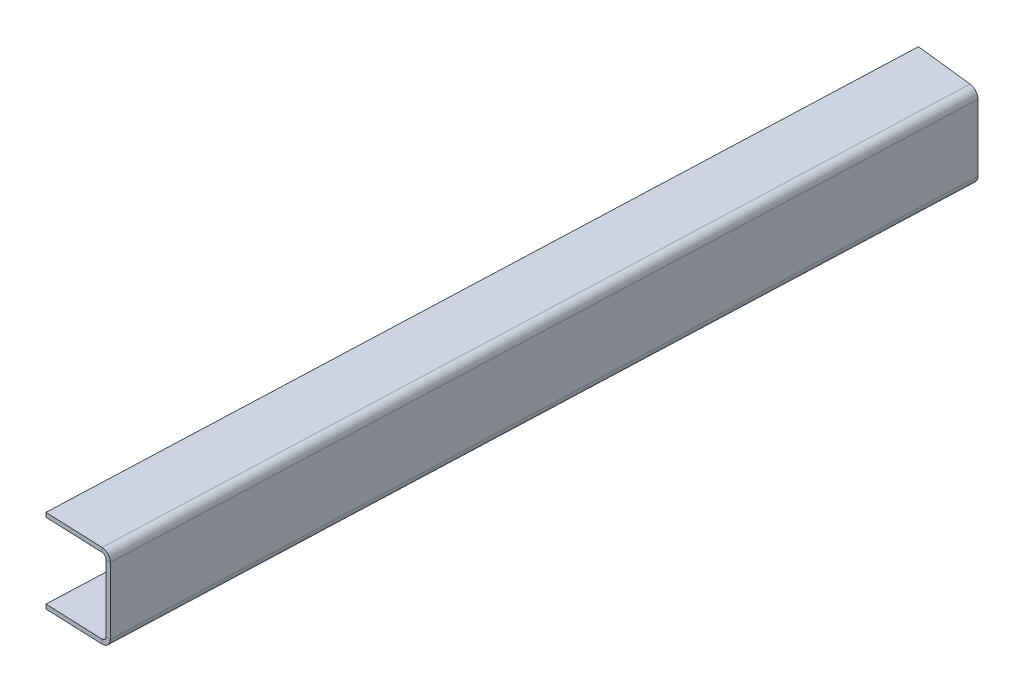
ISO-10303-21;
HEADER;
FILE_DESCRIPTION(('STEP AP214'),'2;1');
FILE_NAME('part.step','',(''),(''),'','','');
FILE_SCHEMA(('AUTOMOTIVE_DESIGN { 1 0 10303 214 1 1 1 1 }'));
ENDSEC;
DATA;
#1=APPLICATION_CONTEXT('core data for automotive mechanical design processes');
#2=APPLICATION_PROTOCOL_DEFINITION('international standard','automotive_design',2000,#1);
#3=PRODUCT_CONTEXT('',#1,'mechanical');
#4=PRODUCT('Part','Part','',(#3));
#5=PRODUCT_RELATED_PRODUCT_CATEGORY('part','',(#4));
#6=PRODUCT_DEFINITION_FORMATION('','',#4);
#7=PRODUCT_DEFINITION_CONTEXT('part definition',#1,'design');
#8=PRODUCT_DEFINITION('design','',#6,#7);
#9=PRODUCT_DEFINITION_SHAPE('','',#8);
#10=(LENGTH_UNIT() NAMED_UNIT(*) SI_UNIT(.MILLI.,.METRE.));
#11=(NAMED_UNIT(*) PLANE_ANGLE_UNIT() SI_UNIT($,.RADIAN.));
#12=(NAMED_UNIT(*) SI_UNIT($,.STERADIAN.) SOLID_ANGLE_UNIT());
#13=UNCERTAINTY_MEASURE_WITH_UNIT(LENGTH_MEASURE(1.E-05),#10,'distance_accuracy_value','');
#14=(GEOMETRIC_REPRESENTATION_CONTEXT(3) GLOBAL_UNCERTAINTY_ASSIGNED_CONTEXT((#13)) GLOBAL_UNIT_ASSIGNED_CONTEXT((#10,
#11,#12)) REPRESENTATION_CONTEXT('',''));
#15=CARTESIAN_POINT('',(0.,0.,0.));
#16=DIRECTION('',(0.,0.,1.));
#17=DIRECTION('',(1.,0.,0.));
#18=AXIS2_PLACEMENT_3D('',#15,#16,#17);
#19=CARTESIAN_POINT('',(2065.76313465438,-1.5585904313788E-13,-579.030473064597));
#20=DIRECTION('',(0.0392134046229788,0.,-0.999230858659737));
#21=DIRECTION('',(0.,1.,0.));
#22=AXIS2_PLACEMENT_3D('',#19,#20,#21);
#23=PLANE('',#22);
#24=DIRECTION('',(-0.999230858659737,0.,-0.0392134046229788));
#25=VECTOR('',#24,1.);
#26=CARTESIAN_POINT('',(2065.76313465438,-28.4987999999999,-579.030473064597));
#27=LINE('',#26,#25);
#28=CARTESIAN_POINT('',(2067.38748433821,-28.4987999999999,-578.966727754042));
#29=VERTEX_POINT('',#28);
#30=CARTESIAN_POINT('',(2065.76313465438,-28.4987999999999,-579.030473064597));
#31=VERTEX_POINT('',#30);
#32=EDGE_CURVE('E12',#29,#31,#27,.T.);
#33=ORIENTED_EDGE('',*,*,#32,.F.);
#34=DIRECTION('',(0.,1.,0.));
#35=VECTOR('',#34,1.);
#36=CARTESIAN_POINT('',(2067.38748433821,-1.5601120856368E-13,-578.966727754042));
#37=LINE('',#36,#35);
#38=CARTESIAN_POINT('',(2067.38748433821,-3.25120000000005,-578.966727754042));
#39=VERTEX_POINT('',#38);
#40=EDGE_CURVE('E134',#29,#39,#37,.T.);
#41=ORIENTED_EDGE('',*,*,#40,.T.);
#42=DIRECTION('',(-0.999230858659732,0.,-0.0392134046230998));
#43=VECTOR('',#42,1.);
#44=CARTESIAN_POINT('',(2065.76313465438,-3.25120000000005,-579.030473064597));
#45=LINE('',#44,#43);
#46=CARTESIAN_POINT('',(2065.76313465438,-3.25120000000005,-579.030473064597));
#47=VERTEX_POINT('',#46);
#48=EDGE_CURVE('E87',#39,#47,#45,.T.);
#49=ORIENTED_EDGE('',*,*,#48,.T.);
#50=DIRECTION('',(0.,1.,0.));
#51=VECTOR('',#50,1.);
#52=CARTESIAN_POINT('',(2065.76313465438,-1.5585904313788E-13,-579.030473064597));
#53=LINE('',#52,#51);
#54=EDGE_CURVE('E136',#31,#47,#53,.T.);
#55=ORIENTED_EDGE('',*,*,#54,.F.);
#56=EDGE_LOOP('',(#33,#41,#49,#55));
#57=FACE_BOUND('',#56,.T.);
#58=ADVANCED_FACE('F75',(#57),#23,.F.);
#59=CARTESIAN_POINT('',(2062.51450641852,-3.25120000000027,-579.159776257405));
#60=CARTESIAN_POINT('',(2061.97305652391,-3.25120000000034,-579.181024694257));
#61=CARTESIAN_POINT('',(2061.4316066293,-3.25120000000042,-579.202273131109));
#62=CARTESIAN_POINT('',(2060.89015673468,-3.25120000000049,-579.22352156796));
#63=CARTESIAN_POINT('',(2062.51450641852,-6.50240000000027,-579.159776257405));
#64=CARTESIAN_POINT('',(2061.97305652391,-7.58613333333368,-579.181024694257));
#65=CARTESIAN_POINT('',(2061.4316066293,-8.66986666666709,-579.202273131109));
#66=CARTESIAN_POINT('',(2060.89015673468,-9.75360000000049,-579.22352156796));
#67=CARTESIAN_POINT('',(2065.76313465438,-6.50239999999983,-579.030473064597));
#68=CARTESIAN_POINT('',(2066.30458454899,-7.58613333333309,-579.009224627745));
#69=CARTESIAN_POINT('',(2066.8460344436,-8.66986666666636,-578.987976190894));
#70=CARTESIAN_POINT('',(2067.38748433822,-9.75359999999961,-578.966727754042));
#71=CARTESIAN_POINT('',(2065.76313465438,-3.25119999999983,-579.030473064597));
#72=CARTESIAN_POINT('',(2066.30458454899,-3.25119999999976,-579.009224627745));
#73=CARTESIAN_POINT('',(2066.8460344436,-3.25119999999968,-578.987976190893));
#74=CARTESIAN_POINT('',(2067.38748433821,-3.25119999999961,-578.966727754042));
#75=CARTESIAN_POINT('',(2065.76313465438,1.69135538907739E-13,-579.030473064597));
#76=CARTESIAN_POINT('',(2066.30458454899,1.08373333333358,-579.009224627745));
#77=CARTESIAN_POINT('',(2066.8460344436,2.16746666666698,-578.987976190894));
#78=CARTESIAN_POINT('',(2067.38748433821,3.25120000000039,-578.966727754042));
#79=CARTESIAN_POINT('',(2062.51450641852,-2.70616862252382E-13,-579.159776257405));
#80=CARTESIAN_POINT('',(2061.97305652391,1.08373333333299,-579.181024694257));
#81=CARTESIAN_POINT('',(2061.43160662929,2.16746666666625,-579.202273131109));
#82=CARTESIAN_POINT('',(2060.89015673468,3.25119999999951,-579.22352156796));
#83=CARTESIAN_POINT('',(2062.51450641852,-3.25120000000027,-579.159776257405));
#84=CARTESIAN_POINT('',(2061.97305652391,-3.25120000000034,-579.181024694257));
#85=CARTESIAN_POINT('',(2061.4316066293,-3.25120000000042,-579.202273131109));
#86=CARTESIAN_POINT('',(2060.89015673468,-3.25120000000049,-579.22352156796));
#87=(BOUNDED_SURFACE() B_SPLINE_SURFACE(3,3,((#59,#60,#61,#62),(#63,#64,#65,#66),(#67,#68,#69,
#70),(#71,#72,#73,#74),(#75,#76,#77,#78),(#79,#80,#81,#82),(#83,#84,#85,#86)),.UNSPECIFIED.,.T.,
.F.,.F.) B_SPLINE_SURFACE_WITH_KNOTS((4,3,4),(4,4),(0.,0.5,1.),(0.,1.),
.UNSPECIFIED.) GEOMETRIC_REPRESENTATION_ITEM() RATIONAL_B_SPLINE_SURFACE(((1.,1.,1.,1.),
(0.333333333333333,0.333333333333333,0.333333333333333,0.333333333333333),(0.333333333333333,
0.333333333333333,0.333333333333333,0.333333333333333),(1.,1.,1.,1.),(0.333333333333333,
0.333333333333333,0.333333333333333,0.333333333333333),(0.333333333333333,0.333333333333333,
0.333333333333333,0.333333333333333),(1.,1.,1.,1.))) REPRESENTATION_ITEM('') SURFACE());
#88=CARTESIAN_POINT('',(2064.13882053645,-3.25120000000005,-579.095124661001));
#89=DIRECTION('',(-0.0394921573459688,0.,0.999219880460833));
#90=DIRECTION('',(-0.999219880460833,-1.35258484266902E-13,-0.0394921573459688));
#91=AXIS2_PLACEMENT_3D('',#88,#89,#90);
#92=ELLIPSE('',#91,3.25120012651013,3.2512);
#93=CARTESIAN_POINT('',(2064.13882053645,0.,-579.095124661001));
#94=VERTEX_POINT('',#93);
#95=EDGE_CURVE('E212',#39,#94,#92,.T.);
#96=DIRECTION('',(0.,-1.,0.));
#97=VECTOR('',#96,1.);
#98=CARTESIAN_POINT('',(2064.13882053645,-1.62560000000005,-579.095124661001));
#99=LINE('',#98,#97);
#100=CARTESIAN_POINT('',(2064.13882053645,-1.62560000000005,-579.095124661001));
#101=VERTEX_POINT('',#100);
#102=EDGE_CURVE('E202',#94,#101,#99,.T.);
#103=CARTESIAN_POINT('',(2064.13882053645,-3.25120000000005,-579.095124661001));
#104=DIRECTION('',(-0.0397709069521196,0.,0.999208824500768));
#105=DIRECTION('',(-0.999208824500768,-1.35321803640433E-13,-0.0397709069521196));
#106=AXIS2_PLACEMENT_3D('',#103,#104,#105);
#107=ELLIPSE('',#106,1.62560025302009,1.6256);
#108=EDGE_CURVE('E210',#47,#101,#107,.T.);
#109=ORIENTED_EDGE('',*,*,#48,.F.);
#110=ORIENTED_EDGE('',*,*,#95,.T.);
#111=ORIENTED_EDGE('',*,*,#102,.T.);
#112=ORIENTED_EDGE('',*,*,#108,.F.);
#113=EDGE_LOOP('',(#109,#110,#111,#112));
#114=FACE_BOUND('',#113,.T.);
#115=ADVANCED_FACE('F209',(#114),#87,.F.);
#116=CARTESIAN_POINT('',(2042.00315002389,-1.62560000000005,-579.976177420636));
#117=DIRECTION('',(-0.0397709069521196,0.,0.999208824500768));
#118=DIRECTION('',(0.999208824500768,0.,0.0397709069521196));
#119=AXIS2_PLACEMENT_3D('',#116,#117,#118);
#120=PLANE('',#119);
#121=ORIENTED_EDGE('',*,*,#102,.F.);
#122=DIRECTION('',(0.999208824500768,0.,0.0397709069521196));
#123=VECTOR('',#122,1.);
#124=CARTESIAN_POINT('',(2042.00315002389,0.,-579.976177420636));
#125=LINE('',#124,#123);
#126=CARTESIAN_POINT('',(2042.00315002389,0.,-579.976177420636));
#127=VERTEX_POINT('',#126);
#128=EDGE_CURVE('E173',#127,#94,#125,.T.);
#129=ORIENTED_EDGE('',*,*,#128,.F.);
#130=DIRECTION('',(0.,-1.,0.));
#131=VECTOR('',#130,1.);
#132=CARTESIAN_POINT('',(2042.00315002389,-1.62560000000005,-579.976177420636));
#133=LINE('',#132,#131);
#134=CARTESIAN_POINT('',(2042.00315002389,-1.62560000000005,-579.976177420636));
#135=VERTEX_POINT('',#134);
#136=EDGE_CURVE('E199',#127,#135,#133,.T.);
#137=ORIENTED_EDGE('',*,*,#136,.T.);
#138=DIRECTION('',(0.999208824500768,0.,0.0397709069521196));
#139=VECTOR('',#138,1.);
#140=CARTESIAN_POINT('',(2042.00315002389,-1.62560000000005,-579.976177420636));
#141=LINE('',#140,#139);
#142=EDGE_CURVE('E229',#135,#101,#141,.T.);
#143=ORIENTED_EDGE('',*,*,#142,.T.);
#144=EDGE_LOOP('',(#121,#129,#137,#143));
#145=FACE_BOUND('',#144,.T.);
#146=ADVANCED_FACE('F230',(#145),#120,.T.);
#147=CARTESIAN_POINT('',(2054.49718988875,-1.62560000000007,-898.34767059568));
#148=DIRECTION('',(-0.999230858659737,0.,-0.0392134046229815));
#149=DIRECTION('',(-0.0392134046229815,0.,0.999230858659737));
#150=AXIS2_PLACEMENT_3D('',#147,#148,#149);
#151=PLANE('',#150);
#152=ORIENTED_EDGE('',*,*,#136,.F.);
#153=DIRECTION('',(-0.0392134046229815,0.,0.999230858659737));
#154=VECTOR('',#153,1.);
#155=CARTESIAN_POINT('',(2054.49718988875,0.,-898.34767059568));
#156=LINE('',#155,#154);
#157=CARTESIAN_POINT('',(2054.49718988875,0.,-898.34767059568));
#158=VERTEX_POINT('',#157);
#159=EDGE_CURVE('E165',#158,#127,#156,.T.);
#160=ORIENTED_EDGE('',*,*,#159,.F.);
#161=DIRECTION('',(0.,-1.,0.));
#162=VECTOR('',#161,1.);
#163=CARTESIAN_POINT('',(2054.49718988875,-1.62560000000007,-898.34767059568));
#164=LINE('',#163,#162);
#165=CARTESIAN_POINT('',(2054.49718988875,-1.62560000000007,-898.34767059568));
#166=VERTEX_POINT('',#165);
#167=EDGE_CURVE('E196',#158,#166,#164,.T.);
#168=ORIENTED_EDGE('',*,*,#167,.T.);
#169=DIRECTION('',(-0.0392134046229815,0.,0.999230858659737));
#170=VECTOR('',#169,1.);
#171=CARTESIAN_POINT('',(2054.49718988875,-1.62560000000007,-898.34767059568));
#172=LINE('',#171,#170);
#173=EDGE_CURVE('E234',#166,#135,#172,.T.);
#174=ORIENTED_EDGE('',*,*,#173,.T.);
#175=EDGE_LOOP('',(#152,#160,#168,#174));
#176=FACE_BOUND('',#175,.T.);
#177=ADVANCED_FACE('F277',(#176),#151,.T.);
#178=CARTESIAN_POINT('',(2079.80427081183,-1.62560000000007,-895.481716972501));
#179=DIRECTION('',(0.112527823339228,0.,-0.993648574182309));
#180=DIRECTION('',(-0.993648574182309,0.,-0.112527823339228));
#181=AXIS2_PLACEMENT_3D('',#178,#179,#180);
#182=PLANE('',#181);
#183=ORIENTED_EDGE('',*,*,#167,.F.);
#184=DIRECTION('',(-0.993648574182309,0.,-0.112527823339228));
#185=VECTOR('',#184,1.);
#186=CARTESIAN_POINT('',(2079.80427081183,0.,-895.481716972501));
#187=LINE('',#186,#185);
#188=CARTESIAN_POINT('',(2076.56934251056,0.,-895.848063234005));
#189=VERTEX_POINT('',#188);
#190=EDGE_CURVE('E170',#189,#158,#187,.T.);
#191=ORIENTED_EDGE('',*,*,#190,.F.);
#192=DIRECTION('',(0.,-1.,-1.36592399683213E-13));
#193=VECTOR('',#192,1.);
#194=CARTESIAN_POINT('',(2076.56934251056,-1.62560000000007,-895.848063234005));
#195=LINE('',#194,#193);
#196=CARTESIAN_POINT('',(2076.56934251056,-1.62560000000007,-895.848063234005));
#197=VERTEX_POINT('',#196);
#198=EDGE_CURVE('E193',#189,#197,#195,.T.);
#199=ORIENTED_EDGE('',*,*,#198,.T.);
#200=DIRECTION('',(-0.993648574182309,0.,-0.112527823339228));
#201=VECTOR('',#200,1.);
#202=CARTESIAN_POINT('',(2079.80427081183,-1.62560000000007,-895.481716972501));
#203=LINE('',#202,#201);
#204=EDGE_CURVE('E235',#197,#166,#203,.T.);
#205=ORIENTED_EDGE('',*,*,#204,.T.);
#206=EDGE_LOOP('',(#183,#191,#199,#205));
#207=FACE_BOUND('',#206,.T.);
#208=ADVANCED_FACE('F304',(#207),#182,.T.);
#209=CARTESIAN_POINT('',(2074.94968933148,-3.25120000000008,-896.031484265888));
#210=CARTESIAN_POINT('',(2074.40823943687,-3.25120000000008,-896.05273270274));
#211=CARTESIAN_POINT('',(2073.86678954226,-3.25120000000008,-896.073981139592));
#212=CARTESIAN_POINT('',(2073.32533964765,-3.25120000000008,-896.095229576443));
#213=CARTESIAN_POINT('',(2074.94968933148,0.,-896.031484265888));
#214=CARTESIAN_POINT('',(2074.40823943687,1.08373333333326,-896.05273270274));
#215=CARTESIAN_POINT('',(2073.86678954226,2.16746666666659,-896.073981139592));
#216=CARTESIAN_POINT('',(2073.32533964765,3.25119999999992,-896.095229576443));
#217=CARTESIAN_POINT('',(2078.18899568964,0.,-895.664642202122));
#218=CARTESIAN_POINT('',(2078.73044558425,1.08373333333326,-895.64339376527));
#219=CARTESIAN_POINT('',(2079.27189547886,2.16746666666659,-895.622145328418));
#220=CARTESIAN_POINT('',(2079.81334537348,3.25119999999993,-895.600896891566));
#221=CARTESIAN_POINT('',(2078.18899568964,-3.25120000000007,-895.664642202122));
#222=CARTESIAN_POINT('',(2078.73044558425,-3.25120000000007,-895.64339376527));
#223=CARTESIAN_POINT('',(2079.27189547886,-3.25120000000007,-895.622145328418));
#224=CARTESIAN_POINT('',(2079.81334537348,-3.25120000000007,-895.600896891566));
#225=CARTESIAN_POINT('',(2078.18899568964,-6.50240000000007,-895.664642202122));
#226=CARTESIAN_POINT('',(2078.73044558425,-7.58613333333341,-895.64339376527));
#227=CARTESIAN_POINT('',(2079.27189547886,-8.66986666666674,-895.622145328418));
#228=CARTESIAN_POINT('',(2079.81334537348,-9.75360000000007,-895.600896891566));
#229=CARTESIAN_POINT('',(2074.94968933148,-6.50240000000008,-896.031484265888));
#230=CARTESIAN_POINT('',(2074.40823943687,-7.58613333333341,-896.05273270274));
#231=CARTESIAN_POINT('',(2073.86678954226,-8.66986666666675,-896.073981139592));
#232=CARTESIAN_POINT('',(2073.32533964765,-9.75360000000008,-896.095229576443));
#233=CARTESIAN_POINT('',(2074.94968933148,-3.25120000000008,-896.031484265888));
#234=CARTESIAN_POINT('',(2074.40823943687,-3.25120000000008,-896.05273270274));
#235=CARTESIAN_POINT('',(2073.86678954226,-3.25120000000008,-896.073981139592));
#236=CARTESIAN_POINT('',(2073.32533964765,-3.25120000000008,-896.095229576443));
#237=(BOUNDED_SURFACE() B_SPLINE_SURFACE(3,3,((#209,#210,#211,#212),(#213,#214,#215,#216),(#217,
#218,#219,#220),(#221,#222,#223,#224),(#225,#226,#227,#228),(#229,#230,#231,#232),(#233,#234,
#235,#236)),.UNSPECIFIED.,.T.,.F.,.F.) B_SPLINE_SURFACE_WITH_KNOTS((4,3,4),(4,4),(0.,0.5,1.),
(0.,1.),.UNSPECIFIED.) GEOMETRIC_REPRESENTATION_ITEM() RATIONAL_B_SPLINE_SURFACE(((1.,1.,1.,1.),
(0.333333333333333,0.333333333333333,0.333333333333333,0.333333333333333),(0.333333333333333,
0.333333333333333,0.333333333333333,0.333333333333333),(1.,1.,1.,1.),(0.333333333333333,
0.333333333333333,0.333333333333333,0.333333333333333),(0.333333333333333,0.333333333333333,
0.333333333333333,0.333333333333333),(1.,1.,1.,1.))) REPRESENTATION_ITEM('') SURFACE());
#238=CARTESIAN_POINT('',(2076.56934251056,-3.25120000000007,-895.848063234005));
#239=DIRECTION('',(0.0759715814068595,0.,-0.997109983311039));
#240=DIRECTION('',(-0.997109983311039,0.,-0.0759715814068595));
#241=AXIS2_PLACEMENT_3D('',#238,#239,#240);
#242=ELLIPSE('',#241,3.25340525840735,3.2512);
#243=CARTESIAN_POINT('',(2079.81334537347,-3.25120000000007,-895.600896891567));
#244=VERTEX_POINT('',#243);
#245=EDGE_CURVE('E175',#189,#244,#242,.T.);
#246=DIRECTION('',(-0.999230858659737,0.,-0.0392134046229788));
#247=VECTOR('',#246,1.);
#248=CARTESIAN_POINT('',(2078.18899568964,-3.25120000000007,-895.664642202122));
#249=LINE('',#248,#247);
#250=CARTESIAN_POINT('',(2078.18899568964,-3.25120000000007,-895.664642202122));
#251=VERTEX_POINT('',#250);
#252=EDGE_CURVE('E191',#244,#251,#249,.T.);
#253=CARTESIAN_POINT('',(2076.56934251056,-3.25120000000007,-895.848063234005));
#254=DIRECTION('',(0.112527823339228,0.,-0.993648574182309));
#255=DIRECTION('',(-0.993648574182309,0.,-0.112527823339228));
#256=AXIS2_PLACEMENT_3D('',#253,#254,#255);
#257=ELLIPSE('',#256,1.63000604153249,1.6256);
#258=EDGE_CURVE('E226',#197,#251,#257,.T.);
#259=ORIENTED_EDGE('',*,*,#198,.F.);
#260=ORIENTED_EDGE('',*,*,#245,.T.);
#261=ORIENTED_EDGE('',*,*,#252,.T.);
#262=ORIENTED_EDGE('',*,*,#258,.F.);
#263=EDGE_LOOP('',(#259,#260,#261,#262));
#264=FACE_BOUND('',#263,.T.);
#265=ADVANCED_FACE('F354',(#264),#237,.F.);
#266=CARTESIAN_POINT('',(2078.18899568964,-1.49842588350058E-13,-895.664642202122));
#267=DIRECTION('',(-0.0392134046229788,0.,0.999230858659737));
#268=DIRECTION('',(0.,-1.,0.));
#269=AXIS2_PLACEMENT_3D('',#266,#267,#268);
#270=PLANE('',#269);
#271=ORIENTED_EDGE('',*,*,#252,.F.);
#272=DIRECTION('',(0.,1.,0.));
#273=VECTOR('',#272,1.);
#274=CARTESIAN_POINT('',(2079.81334537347,-1.5601120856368E-13,-895.600896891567));
#275=LINE('',#274,#273);
#276=CARTESIAN_POINT('',(2079.81334537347,-28.4988,-895.600896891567));
#277=VERTEX_POINT('',#276);
#278=EDGE_CURVE('E164',#244,#277,#275,.F.);
#279=ORIENTED_EDGE('',*,*,#278,.T.);
#280=DIRECTION('',(-0.999230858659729,0.,-0.0392134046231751));
#281=VECTOR('',#280,1.);
#282=CARTESIAN_POINT('',(2078.18899568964,-28.4988,-895.664642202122));
#283=LINE('',#282,#281);
#284=CARTESIAN_POINT('',(2078.18899568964,-28.4988,-895.664642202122));
#285=VERTEX_POINT('',#284);
#286=EDGE_CURVE('E188',#277,#285,#283,.T.);
#287=ORIENTED_EDGE('',*,*,#286,.T.);
#288=DIRECTION('',(0.,-1.,0.));
#289=VECTOR('',#288,1.);
#290=CARTESIAN_POINT('',(2078.18899568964,-1.49842588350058E-13,-895.664642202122));
#291=LINE('',#290,#289);
#292=EDGE_CURVE('E281',#251,#285,#291,.T.);
#293=ORIENTED_EDGE('',*,*,#292,.F.);
#294=EDGE_LOOP('',(#271,#279,#287,#293));
#295=FACE_BOUND('',#294,.T.);
#296=ADVANCED_FACE('F319',(#295),#270,.F.);
#297=CARTESIAN_POINT('',(2078.18899568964,-28.4988,-895.664642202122));
#298=CARTESIAN_POINT('',(2078.73044558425,-28.4988,-895.64339376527));
#299=CARTESIAN_POINT('',(2079.27189547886,-28.4988,-895.622145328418));
#300=CARTESIAN_POINT('',(2079.81334537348,-28.4988,-895.600896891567));
#301=CARTESIAN_POINT('',(2078.18899568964,-31.75,-895.664642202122));
#302=CARTESIAN_POINT('',(2078.73044558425,-32.8337333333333,-895.64339376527));
#303=CARTESIAN_POINT('',(2079.27189547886,-33.9174666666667,-895.622145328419));
#304=CARTESIAN_POINT('',(2079.81334537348,-35.0012,-895.600896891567));
#305=CARTESIAN_POINT('',(2074.94968933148,-31.75,-896.031484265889));
#306=CARTESIAN_POINT('',(2074.40823943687,-32.8337333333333,-896.052732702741));
#307=CARTESIAN_POINT('',(2073.86678954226,-33.9174666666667,-896.073981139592));
#308=CARTESIAN_POINT('',(2073.32533964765,-35.0012,-896.095229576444));
#309=CARTESIAN_POINT('',(2074.94968933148,-28.4988,-896.031484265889));
#310=CARTESIAN_POINT('',(2074.40823943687,-28.4988,-896.052732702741));
#311=CARTESIAN_POINT('',(2073.86678954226,-28.4988,-896.073981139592));
#312=CARTESIAN_POINT('',(2073.32533964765,-28.4988,-896.095229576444));
#313=CARTESIAN_POINT('',(2074.94968933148,-25.2476,-896.031484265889));
#314=CARTESIAN_POINT('',(2074.40823943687,-24.1638666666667,-896.052732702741));
#315=CARTESIAN_POINT('',(2073.86678954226,-23.0801333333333,-896.073981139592));
#316=CARTESIAN_POINT('',(2073.32533964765,-21.9964,-896.095229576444));
#317=CARTESIAN_POINT('',(2078.18899568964,-25.2476,-895.664642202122));
#318=CARTESIAN_POINT('',(2078.73044558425,-24.1638666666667,-895.64339376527));
#319=CARTESIAN_POINT('',(2079.27189547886,-23.0801333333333,-895.622145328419));
#320=CARTESIAN_POINT('',(2079.81334537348,-21.9964,-895.600896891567));
#321=CARTESIAN_POINT('',(2078.18899568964,-28.4988,-895.664642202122));
#322=CARTESIAN_POINT('',(2078.73044558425,-28.4988,-895.64339376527));
#323=CARTESIAN_POINT('',(2079.27189547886,-28.4988,-895.622145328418));
#324=CARTESIAN_POINT('',(2079.81334537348,-28.4988,-895.600896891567));
#325=(BOUNDED_SURFACE() B_SPLINE_SURFACE(3,3,((#297,#298,#299,#300),(#301,#302,#303,#304),(#305,
#306,#307,#308),(#309,#310,#311,#312),(#313,#314,#315,#316),(#317,#318,#319,#320),(#321,#322,
#323,#324)),.UNSPECIFIED.,.T.,.F.,.F.) B_SPLINE_SURFACE_WITH_KNOTS((4,3,4),(4,4),(0.,0.5,1.),
(0.,1.),.UNSPECIFIED.) GEOMETRIC_REPRESENTATION_ITEM() RATIONAL_B_SPLINE_SURFACE(((1.,1.,1.,1.),
(0.333333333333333,0.333333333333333,0.333333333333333,0.333333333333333),(0.333333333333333,
0.333333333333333,0.333333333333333,0.333333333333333),(1.,1.,1.,1.),(0.333333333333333,
0.333333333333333,0.333333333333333,0.333333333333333),(0.333333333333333,0.333333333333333,
0.333333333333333,0.333333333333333),(1.,1.,1.,1.))) REPRESENTATION_ITEM('') SURFACE());
#326=CARTESIAN_POINT('',(2076.56934251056,-28.4988,-895.848063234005));
#327=DIRECTION('',(0.0759715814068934,0.,-0.997109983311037));
#328=DIRECTION('',(0.997109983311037,0.,0.0759715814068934));
#329=AXIS2_PLACEMENT_3D('',#326,#327,#328);
#330=ELLIPSE('',#329,3.25340525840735,3.2512);
#331=CARTESIAN_POINT('',(2076.56934251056,-31.75,-895.848063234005));
#332=VERTEX_POINT('',#331);
#333=EDGE_CURVE('E152',#277,#332,#330,.T.);
#334=DIRECTION('',(0.,1.,0.));
#335=VECTOR('',#334,1.);
#336=CARTESIAN_POINT('',(2076.56934251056,-30.1244,-895.848063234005));
#337=LINE('',#336,#335);
#338=CARTESIAN_POINT('',(2076.56934251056,-30.1244,-895.848063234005));
#339=VERTEX_POINT('',#338);
#340=EDGE_CURVE('E185',#332,#339,#337,.T.);
#341=CARTESIAN_POINT('',(2076.56934251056,-28.4988,-895.848063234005));
#342=DIRECTION('',(0.112527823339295,0.,-0.993648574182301));
#343=DIRECTION('',(0.993648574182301,0.,0.112527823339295));
#344=AXIS2_PLACEMENT_3D('',#341,#342,#343);
#345=ELLIPSE('',#344,1.6300060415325,1.6256);
#346=EDGE_CURVE('E251',#285,#339,#345,.T.);
#347=ORIENTED_EDGE('',*,*,#286,.F.);
#348=ORIENTED_EDGE('',*,*,#333,.T.);
#349=ORIENTED_EDGE('',*,*,#340,.T.);
#350=ORIENTED_EDGE('',*,*,#346,.F.);
#351=EDGE_LOOP('',(#347,#348,#349,#350));
#352=FACE_BOUND('',#351,.T.);
#353=ADVANCED_FACE('F323',(#352),#325,.F.);
#354=CARTESIAN_POINT('',(2054.49718988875,-30.1244,-898.347670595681));
#355=DIRECTION('',(0.112527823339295,0.,-0.993648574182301));
#356=DIRECTION('',(0.993648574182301,0.,0.112527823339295));
#357=AXIS2_PLACEMENT_3D('',#354,#355,#356);
#358=PLANE('',#357);
#359=ORIENTED_EDGE('',*,*,#340,.F.);
#360=DIRECTION('',(0.993648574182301,0.,0.112527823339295));
#361=VECTOR('',#360,1.);
#362=CARTESIAN_POINT('',(2054.49718988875,-31.75,-898.347670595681));
#363=LINE('',#362,#361);
#364=CARTESIAN_POINT('',(2054.49718988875,-31.75,-898.347670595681));
#365=VERTEX_POINT('',#364);
#366=EDGE_CURVE('E259',#365,#332,#363,.T.);
#367=ORIENTED_EDGE('',*,*,#366,.F.);
#368=DIRECTION('',(0.,1.,0.));
#369=VECTOR('',#368,1.);
#370=CARTESIAN_POINT('',(2054.49718988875,-30.1244,-898.347670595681));
#371=LINE('',#370,#369);
#372=CARTESIAN_POINT('',(2054.49718988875,-30.1244,-898.347670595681));
#373=VERTEX_POINT('',#372);
#374=EDGE_CURVE('E182',#365,#373,#371,.T.);
#375=ORIENTED_EDGE('',*,*,#374,.T.);
#376=DIRECTION('',(0.993648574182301,0.,0.112527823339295));
#377=VECTOR('',#376,1.);
#378=CARTESIAN_POINT('',(2054.49718988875,-30.1244,-898.347670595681));
#379=LINE('',#378,#377);
#380=EDGE_CURVE('E290',#373,#339,#379,.T.);
#381=ORIENTED_EDGE('',*,*,#380,.T.);
#382=EDGE_LOOP('',(#359,#367,#375,#381));
#383=FACE_BOUND('',#382,.T.);
#384=ADVANCED_FACE('F371',(#383),#358,.T.);
#385=CARTESIAN_POINT('',(2042.00315002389,-30.1243999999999,-579.976177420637));
#386=DIRECTION('',(-0.999230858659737,0.,-0.0392134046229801));
#387=DIRECTION('',(0.0392134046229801,0.,-0.999230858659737));
#388=AXIS2_PLACEMENT_3D('',#385,#386,#387);
#389=PLANE('',#388);
#390=ORIENTED_EDGE('',*,*,#374,.F.);
#391=DIRECTION('',(0.0392134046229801,0.,-0.999230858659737));
#392=VECTOR('',#391,1.);
#393=CARTESIAN_POINT('',(2042.00315002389,-31.7499999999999,-579.976177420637));
#394=LINE('',#393,#392);
#395=CARTESIAN_POINT('',(2042.00315002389,-31.7499999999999,-579.976177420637));
#396=VERTEX_POINT('',#395);
#397=EDGE_CURVE('E252',#396,#365,#394,.T.);
#398=ORIENTED_EDGE('',*,*,#397,.F.);
#399=DIRECTION('',(0.,1.,0.));
#400=VECTOR('',#399,1.);
#401=CARTESIAN_POINT('',(2042.00315002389,-30.1243999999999,-579.976177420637));
#402=LINE('',#401,#400);
#403=CARTESIAN_POINT('',(2042.00315002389,-30.1243999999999,-579.976177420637));
#404=VERTEX_POINT('',#403);
#405=EDGE_CURVE('E179',#396,#404,#402,.T.);
#406=ORIENTED_EDGE('',*,*,#405,.T.);
#407=DIRECTION('',(0.0392134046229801,0.,-0.999230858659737));
#408=VECTOR('',#407,1.);
#409=CARTESIAN_POINT('',(2042.00315002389,-30.1243999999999,-579.976177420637));
#410=LINE('',#409,#408);
#411=EDGE_CURVE('E293',#404,#373,#410,.T.);
#412=ORIENTED_EDGE('',*,*,#411,.T.);
#413=EDGE_LOOP('',(#390,#398,#406,#412));
#414=FACE_BOUND('',#413,.T.);
#415=ADVANCED_FACE('F379',(#414),#389,.T.);
#416=CARTESIAN_POINT('',(2067.38305811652,-30.1243999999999,-578.96599622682));
#417=DIRECTION('',(-0.0397709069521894,0.,0.999208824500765));
#418=DIRECTION('',(-0.999208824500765,0.,-0.0397709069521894));
#419=AXIS2_PLACEMENT_3D('',#416,#417,#418);
#420=PLANE('',#419);
#421=ORIENTED_EDGE('',*,*,#405,.F.);
#422=DIRECTION('',(-0.999208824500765,0.,-0.0397709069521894));
#423=VECTOR('',#422,1.);
#424=CARTESIAN_POINT('',(2067.38305811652,-31.7499999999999,-578.96599622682));
#425=LINE('',#424,#423);
#426=CARTESIAN_POINT('',(2064.13882053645,-31.7499999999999,-579.095124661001));
#427=VERTEX_POINT('',#426);
#428=EDGE_CURVE('E256',#427,#396,#425,.T.);
#429=ORIENTED_EDGE('',*,*,#428,.F.);
#430=DIRECTION('',(2.30499674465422E-13,1.,0.));
#431=VECTOR('',#430,1.);
#432=CARTESIAN_POINT('',(2064.13882053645,-30.1243999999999,-579.095124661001));
#433=LINE('',#432,#431);
#434=CARTESIAN_POINT('',(2064.13882053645,-30.1243999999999,-579.095124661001));
#435=VERTEX_POINT('',#434);
#436=EDGE_CURVE('E81',#427,#435,#433,.T.);
#437=ORIENTED_EDGE('',*,*,#436,.T.);
#438=DIRECTION('',(-0.999208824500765,0.,-0.0397709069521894));
#439=VECTOR('',#438,1.);
#440=CARTESIAN_POINT('',(2067.38305811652,-30.1243999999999,-578.96599622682));
#441=LINE('',#440,#439);
#442=EDGE_CURVE('E287',#435,#404,#441,.T.);
#443=ORIENTED_EDGE('',*,*,#442,.T.);
#444=EDGE_LOOP('',(#421,#429,#437,#443));
#445=FACE_BOUND('',#444,.T.);
#446=ADVANCED_FACE('F383',(#445),#420,.T.);
#447=CARTESIAN_POINT('',(2065.76313465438,-28.4987999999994,-579.030473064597));
#448=CARTESIAN_POINT('',(2066.30458454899,-28.4987999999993,-579.009224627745));
#449=CARTESIAN_POINT('',(2066.8460344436,-28.4987999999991,-578.987976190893));
#450=CARTESIAN_POINT('',(2067.38748433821,-28.4987999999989,-578.966727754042));
#451=CARTESIAN_POINT('',(2065.76313465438,-25.2475999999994,-579.030473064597));
#452=CARTESIAN_POINT('',(2066.30458454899,-24.1638666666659,-579.009224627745));
#453=CARTESIAN_POINT('',(2066.8460344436,-23.0801333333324,-578.987976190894));
#454=CARTESIAN_POINT('',(2067.38748433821,-21.9963999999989,-578.966727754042));
#455=CARTESIAN_POINT('',(2062.51450641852,-25.2476000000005,-579.159776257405));
#456=CARTESIAN_POINT('',(2061.97305652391,-24.1638666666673,-579.181024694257));
#457=CARTESIAN_POINT('',(2061.43160662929,-23.0801333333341,-579.202273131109));
#458=CARTESIAN_POINT('',(2060.89015673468,-21.996400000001,-579.223521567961));
#459=CARTESIAN_POINT('',(2062.51450641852,-28.4988000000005,-579.159776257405));
#460=CARTESIAN_POINT('',(2061.97305652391,-28.4988000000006,-579.181024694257));
#461=CARTESIAN_POINT('',(2061.4316066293,-28.4988000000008,-579.202273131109));
#462=CARTESIAN_POINT('',(2060.89015673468,-28.498800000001,-579.22352156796));
#463=CARTESIAN_POINT('',(2062.51450641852,-31.7500000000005,-579.159776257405));
#464=CARTESIAN_POINT('',(2061.97305652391,-32.833733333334,-579.181024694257));
#465=CARTESIAN_POINT('',(2061.4316066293,-33.9174666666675,-579.202273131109));
#466=CARTESIAN_POINT('',(2060.89015673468,-35.001200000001,-579.22352156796));
#467=CARTESIAN_POINT('',(2065.76313465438,-31.7499999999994,-579.030473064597));
#468=CARTESIAN_POINT('',(2066.30458454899,-32.8337333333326,-579.009224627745));
#469=CARTESIAN_POINT('',(2066.8460344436,-33.9174666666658,-578.987976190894));
#470=CARTESIAN_POINT('',(2067.38748433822,-35.0011999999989,-578.966727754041));
#471=CARTESIAN_POINT('',(2065.76313465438,-28.4987999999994,-579.030473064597));
#472=CARTESIAN_POINT('',(2066.30458454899,-28.4987999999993,-579.009224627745));
#473=CARTESIAN_POINT('',(2066.8460344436,-28.4987999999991,-578.987976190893));
#474=CARTESIAN_POINT('',(2067.38748433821,-28.4987999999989,-578.966727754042));
#475=(BOUNDED_SURFACE() B_SPLINE_SURFACE(3,3,((#447,#448,#449,#450),(#451,#452,#453,#454),(#455,
#456,#457,#458),(#459,#460,#461,#462),(#463,#464,#465,#466),(#467,#468,#469,#470),(#471,#472,
#473,#474)),.UNSPECIFIED.,.T.,.F.,.F.) B_SPLINE_SURFACE_WITH_KNOTS((4,3,4),(4,4),(0.,0.5,1.),
(0.,1.),.UNSPECIFIED.) GEOMETRIC_REPRESENTATION_ITEM() RATIONAL_B_SPLINE_SURFACE(((1.,1.,1.,1.),
(0.333333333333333,0.333333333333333,0.333333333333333,0.333333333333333),(0.333333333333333,
0.333333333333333,0.333333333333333,0.333333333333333),(1.,1.,1.,1.),(0.333333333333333,
0.333333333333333,0.333333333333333,0.333333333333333),(0.333333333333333,0.333333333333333,
0.333333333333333,0.333333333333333),(1.,1.,1.,1.))) REPRESENTATION_ITEM('') SURFACE());
#476=CARTESIAN_POINT('',(2064.13882053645,-28.4987999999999,-579.095124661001));
#477=DIRECTION('',(-0.0394921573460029,0.,0.999219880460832));
#478=DIRECTION('',(0.999219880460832,3.13735655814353E-13,0.0394921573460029));
#479=AXIS2_PLACEMENT_3D('',#476,#477,#478);
#480=ELLIPSE('',#479,3.25120012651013,3.2512);
#481=EDGE_CURVE('E149',#427,#29,#480,.T.);
#482=CARTESIAN_POINT('',(2064.13882053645,-28.4987999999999,-579.095124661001));
#483=DIRECTION('',(-0.0397709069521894,0.,0.999208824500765));
#484=DIRECTION('',(0.999208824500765,3.14098008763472E-13,0.0397709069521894));
#485=AXIS2_PLACEMENT_3D('',#482,#483,#484);
#486=ELLIPSE('',#485,1.62560025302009,1.6256);
#487=EDGE_CURVE('E247',#435,#31,#486,.T.);
#488=ORIENTED_EDGE('',*,*,#481,.T.);
#489=ORIENTED_EDGE('',*,*,#32,.T.);
#490=ORIENTED_EDGE('',*,*,#487,.F.);
#491=ORIENTED_EDGE('',*,*,#436,.F.);
#492=EDGE_LOOP('',(#488,#489,#490,#491));
#493=FACE_BOUND('',#492,.T.);
#494=ADVANCED_FACE('F77',(#493),#475,.F.);
#495=CARTESIAN_POINT('',(0.,-30.1243999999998,0.));
#496=DIRECTION('',(0.,-1.,0.));
#497=DIRECTION('',(0.,0.,-1.));
#498=AXIS2_PLACEMENT_3D('',#495,#496,#497);
#499=PLANE('',#498);
#500=ORIENTED_EDGE('',*,*,#442,.F.);
#501=DIRECTION('',(0.0392134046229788,0.,-0.999230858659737));
#502=VECTOR('',#501,1.);
#503=CARTESIAN_POINT('',(2076.5646460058,-30.1244,-895.728387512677));
#504=LINE('',#503,#502);
#505=EDGE_CURVE('E244',#435,#339,#504,.T.);
#506=ORIENTED_EDGE('',*,*,#505,.T.);
#507=ORIENTED_EDGE('',*,*,#380,.F.);
#508=ORIENTED_EDGE('',*,*,#411,.F.);
#509=EDGE_LOOP('',(#500,#506,#507,#508));
#510=FACE_BOUND('',#509,.T.);
#511=ADVANCED_FACE('F408',(#510),#499,.F.);
#512=CARTESIAN_POINT('',(2039.90067867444,-1.55887130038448E-13,79.9932547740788));
#513=DIRECTION('',(0.999230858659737,0.,0.0392134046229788));
#514=DIRECTION('',(0.0392134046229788,0.,-0.999230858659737));
#515=AXIS2_PLACEMENT_3D('',#512,#513,#514);
#516=PLANE('',#515);
#517=ORIENTED_EDGE('',*,*,#54,.T.);
#518=DIRECTION('',(-0.0392134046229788,0.,0.999230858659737));
#519=VECTOR('',#518,1.);
#520=CARTESIAN_POINT('',(2078.18899568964,-3.25120000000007,-895.664642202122));
#521=LINE('',#520,#519);
#522=EDGE_CURVE('E225',#47,#251,#521,.F.);
#523=ORIENTED_EDGE('',*,*,#522,.T.);
#524=ORIENTED_EDGE('',*,*,#292,.T.);
#525=DIRECTION('',(0.0392134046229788,0.,-0.999230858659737));
#526=VECTOR('',#525,1.);
#527=CARTESIAN_POINT('',(2065.76313465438,-28.4987999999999,-579.030473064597));
#528=LINE('',#527,#526);
#529=EDGE_CURVE('E241',#285,#31,#528,.F.);
#530=ORIENTED_EDGE('',*,*,#529,.T.);
#531=EDGE_LOOP('',(#517,#523,#524,#530));
#532=FACE_BOUND('',#531,.T.);
#533=ADVANCED_FACE('F322',(#532),#516,.F.);
#534=CARTESIAN_POINT('',(0.,-1.6256,0.));
#535=DIRECTION('',(0.,1.,0.));
#536=DIRECTION('',(0.,0.,1.));
#537=AXIS2_PLACEMENT_3D('',#534,#535,#536);
#538=PLANE('',#537);
#539=ORIENTED_EDGE('',*,*,#204,.F.);
#540=DIRECTION('',(-0.0392134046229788,0.,0.999230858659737));
#541=VECTOR('',#540,1.);
#542=CARTESIAN_POINT('',(2064.13878497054,-1.62560000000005,-579.094218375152));
#543=LINE('',#542,#541);
#544=EDGE_CURVE('E223',#197,#101,#543,.T.);
#545=ORIENTED_EDGE('',*,*,#544,.T.);
#546=ORIENTED_EDGE('',*,*,#142,.F.);
#547=ORIENTED_EDGE('',*,*,#173,.F.);
#548=EDGE_LOOP('',(#539,#545,#546,#547));
#549=FACE_BOUND('',#548,.T.);
#550=ADVANCED_FACE('F238',(#549),#538,.F.);
#551=CARTESIAN_POINT('',(2038.27398708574,-28.4987999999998,79.9891855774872));
#552=DIRECTION('',(-0.0392134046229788,0.,0.999230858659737));
#553=DIRECTION('',(0.999230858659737,0.,0.0392134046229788));
#554=AXIS2_PLACEMENT_3D('',#551,#552,#553);
#555=CYLINDRICAL_SURFACE('',#554,1.6256);
#556=ORIENTED_EDGE('',*,*,#487,.T.);
#557=ORIENTED_EDGE('',*,*,#529,.F.);
#558=ORIENTED_EDGE('',*,*,#346,.T.);
#559=ORIENTED_EDGE('',*,*,#505,.F.);
#560=EDGE_LOOP('',(#556,#557,#558,#559));
#561=FACE_BOUND('',#560,.T.);
#562=ADVANCED_FACE('F324',(#561),#555,.F.);
#563=CARTESIAN_POINT('',(2038.27398708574,-3.2512,79.9891855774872));
#564=DIRECTION('',(0.0392134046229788,0.,-0.999230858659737));
#565=DIRECTION('',(-0.999230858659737,0.,-0.0392134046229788));
#566=AXIS2_PLACEMENT_3D('',#563,#564,#565);
#567=CYLINDRICAL_SURFACE('',#566,1.6256);
#568=ORIENTED_EDGE('',*,*,#258,.T.);
#569=ORIENTED_EDGE('',*,*,#522,.F.);
#570=ORIENTED_EDGE('',*,*,#108,.T.);
#571=ORIENTED_EDGE('',*,*,#544,.F.);
#572=EDGE_LOOP('',(#568,#569,#570,#571));
#573=FACE_BOUND('',#572,.T.);
#574=ADVANCED_FACE('F221',(#573),#567,.F.);
#575=CARTESIAN_POINT('',(0.,-31.7499999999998,0.));
#576=DIRECTION('',(0.,-1.,0.));
#577=DIRECTION('',(0.,0.,-1.));
#578=AXIS2_PLACEMENT_3D('',#575,#576,#577);
#579=PLANE('',#578);
#580=ORIENTED_EDGE('',*,*,#428,.T.);
#581=ORIENTED_EDGE('',*,*,#397,.T.);
#582=ORIENTED_EDGE('',*,*,#366,.T.);
#583=DIRECTION('',(-0.0392134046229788,0.,0.999230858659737));
#584=VECTOR('',#583,1.);
#585=CARTESIAN_POINT('',(2038.27398708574,-31.7499999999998,79.9891855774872));
#586=LINE('',#585,#584);
#587=EDGE_CURVE('E157',#427,#332,#586,.F.);
#588=ORIENTED_EDGE('',*,*,#587,.F.);
#589=EDGE_LOOP('',(#580,#581,#582,#588));
#590=FACE_BOUND('',#589,.T.);
#591=ADVANCED_FACE('F331',(#590),#579,.T.);
#592=CARTESIAN_POINT('',(2041.52502835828,-1.5601120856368E-13,80.0570000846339));
#593=DIRECTION('',(0.999230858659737,0.,0.0392134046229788));
#594=DIRECTION('',(0.0392134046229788,0.,-0.999230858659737));
#595=AXIS2_PLACEMENT_3D('',#592,#593,#594);
#596=PLANE('',#595);
#597=ORIENTED_EDGE('',*,*,#40,.F.);
#598=DIRECTION('',(0.0392134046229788,0.,-0.999230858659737));
#599=VECTOR('',#598,1.);
#600=CARTESIAN_POINT('',(2041.52502835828,-28.4988,80.0570000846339));
#601=LINE('',#600,#599);
#602=EDGE_CURVE('E146',#277,#29,#601,.F.);
#603=ORIENTED_EDGE('',*,*,#602,.F.);
#604=ORIENTED_EDGE('',*,*,#278,.F.);
#605=DIRECTION('',(0.0392134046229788,0.,-0.999230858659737));
#606=VECTOR('',#605,1.);
#607=CARTESIAN_POINT('',(2041.52502835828,-3.25120000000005,80.0570000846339));
#608=LINE('',#607,#606);
#609=EDGE_CURVE('E162',#39,#244,#608,.T.);
#610=ORIENTED_EDGE('',*,*,#609,.F.);
#611=EDGE_LOOP('',(#597,#603,#604,#610));
#612=FACE_BOUND('',#611,.T.);
#613=ADVANCED_FACE('F160',(#612),#596,.T.);
#614=CARTESIAN_POINT('',(0.,0.,0.));
#615=DIRECTION('',(0.,1.,0.));
#616=DIRECTION('',(0.,0.,1.));
#617=AXIS2_PLACEMENT_3D('',#614,#615,#616);
#618=PLANE('',#617);
#619=ORIENTED_EDGE('',*,*,#190,.T.);
#620=ORIENTED_EDGE('',*,*,#159,.T.);
#621=ORIENTED_EDGE('',*,*,#128,.T.);
#622=DIRECTION('',(0.0392134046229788,0.,-0.999230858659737));
#623=VECTOR('',#622,1.);
#624=CARTESIAN_POINT('',(2038.27398708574,0.,79.9891855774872));
#625=LINE('',#624,#623);
#626=EDGE_CURVE('E156',#189,#94,#625,.F.);
#627=ORIENTED_EDGE('',*,*,#626,.F.);
#628=EDGE_LOOP('',(#619,#620,#621,#627));
#629=FACE_BOUND('',#628,.T.);
#630=ADVANCED_FACE('F272',(#629),#618,.T.);
#631=CARTESIAN_POINT('',(2038.27398708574,-28.4987999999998,79.9891855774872));
#632=DIRECTION('',(-0.0392134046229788,0.,0.999230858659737));
#633=DIRECTION('',(0.999230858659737,0.,0.0392134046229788));
#634=AXIS2_PLACEMENT_3D('',#631,#632,#633);
#635=CYLINDRICAL_SURFACE('',#634,3.2512);
#636=ORIENTED_EDGE('',*,*,#481,.F.);
#637=ORIENTED_EDGE('',*,*,#587,.T.);
#638=ORIENTED_EDGE('',*,*,#333,.F.);
#639=ORIENTED_EDGE('',*,*,#602,.T.);
#640=EDGE_LOOP('',(#636,#637,#638,#639));
#641=FACE_BOUND('',#640,.T.);
#642=ADVANCED_FACE('F147',(#641),#635,.T.);
#643=CARTESIAN_POINT('',(2038.27398708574,-3.2512,79.9891855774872));
#644=DIRECTION('',(0.0392134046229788,0.,-0.999230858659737));
#645=DIRECTION('',(-0.999230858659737,0.,-0.0392134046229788));
#646=AXIS2_PLACEMENT_3D('',#643,#644,#645);
#647=CYLINDRICAL_SURFACE('',#646,3.2512);
#648=ORIENTED_EDGE('',*,*,#245,.F.);
#649=ORIENTED_EDGE('',*,*,#626,.T.);
#650=ORIENTED_EDGE('',*,*,#95,.F.);
#651=ORIENTED_EDGE('',*,*,#609,.T.);
#652=EDGE_LOOP('',(#648,#649,#650,#651));
#653=FACE_BOUND('',#652,.T.);
#654=ADVANCED_FACE('F388',(#653),#647,.T.);
#655=CLOSED_SHELL('',(#58,#115,#146,#177,#208,#265,#296,#353,#384,#415,#446,#494,#511,#533,#550,
#562,#574,#591,#613,#630,#642,#654));
#656=MANIFOLD_SOLID_BREP('B2',#655);
#657=ADVANCED_BREP_SHAPE_REPRESENTATION('',(#18,#656),#14);
#658=SHAPE_DEFINITION_REPRESENTATION(#9,#657);
ENDSEC;
END-ISO-10303-21;
